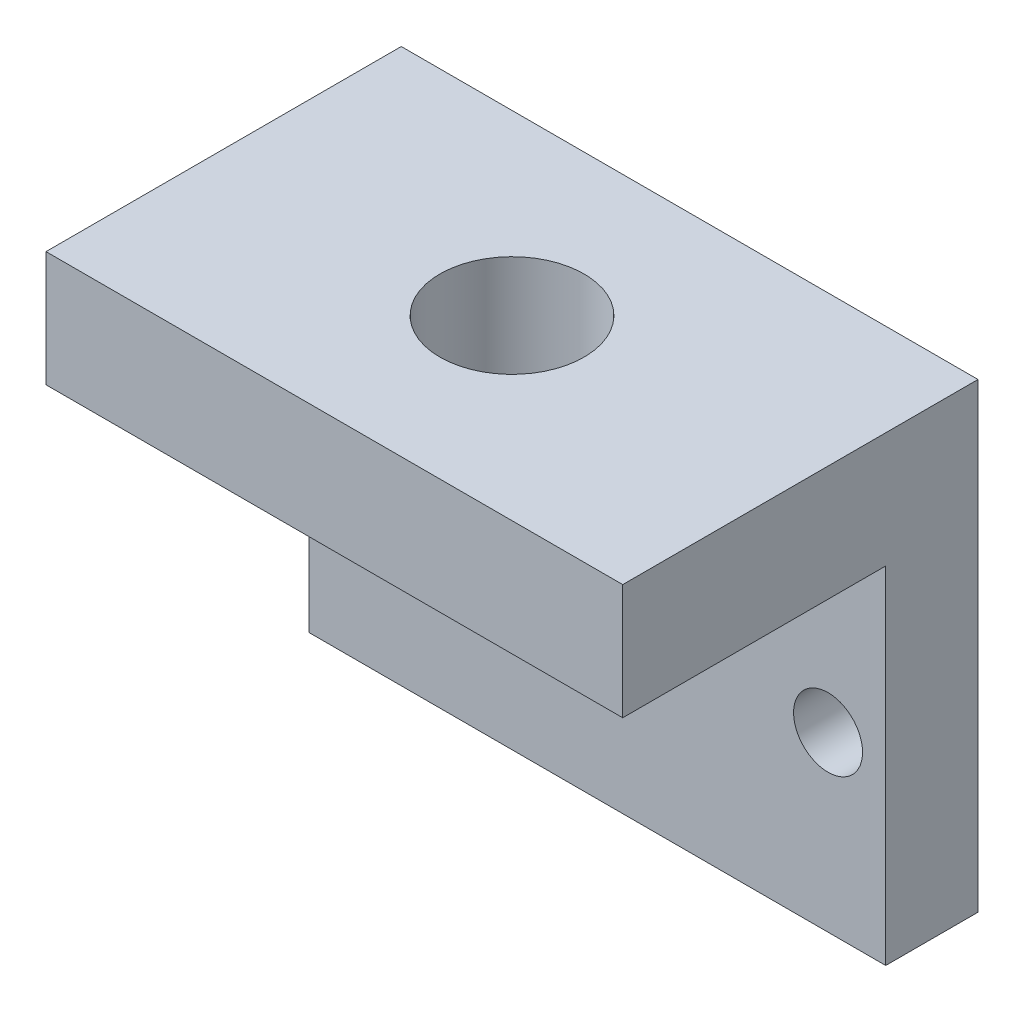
ISO-10303-21;
HEADER;
FILE_DESCRIPTION(('STEP AP214'),'2;1');
FILE_NAME('part.step','',(''),(''),'','','');
FILE_SCHEMA(('AUTOMOTIVE_DESIGN { 1 0 10303 214 1 1 1 1 }'));
ENDSEC;
DATA;
#1=APPLICATION_CONTEXT('core data for automotive mechanical design processes');
#2=APPLICATION_PROTOCOL_DEFINITION('international standard','automotive_design',2000,#1);
#3=PRODUCT_CONTEXT('',#1,'mechanical');
#4=PRODUCT('Part','Part','',(#3));
#5=PRODUCT_RELATED_PRODUCT_CATEGORY('part','',(#4));
#6=PRODUCT_DEFINITION_FORMATION('','',#4);
#7=PRODUCT_DEFINITION_CONTEXT('part definition',#1,'design');
#8=PRODUCT_DEFINITION('design','',#6,#7);
#9=PRODUCT_DEFINITION_SHAPE('','',#8);
#10=(LENGTH_UNIT() NAMED_UNIT(*) SI_UNIT(.MILLI.,.METRE.));
#11=(NAMED_UNIT(*) PLANE_ANGLE_UNIT() SI_UNIT($,.RADIAN.));
#12=(NAMED_UNIT(*) SI_UNIT($,.STERADIAN.) SOLID_ANGLE_UNIT());
#13=UNCERTAINTY_MEASURE_WITH_UNIT(LENGTH_MEASURE(1.E-05),#10,'distance_accuracy_value','');
#14=(GEOMETRIC_REPRESENTATION_CONTEXT(3) GLOBAL_UNCERTAINTY_ASSIGNED_CONTEXT((#13)) GLOBAL_UNIT_ASSIGNED_CONTEXT((#10,
#11,#12)) REPRESENTATION_CONTEXT('',''));
#15=CARTESIAN_POINT('',(0.,0.,0.));
#16=DIRECTION('',(0.,0.,1.));
#17=DIRECTION('',(1.,0.,0.));
#18=AXIS2_PLACEMENT_3D('',#15,#16,#17);
#19=CARTESIAN_POINT('',(-15.875,6.35,9.779));
#20=DIRECTION('',(0.,1.,0.));
#21=DIRECTION('',(0.,0.,1.));
#22=AXIS2_PLACEMENT_3D('',#19,#20,#21);
#23=PLANE('',#22);
#24=DIRECTION('',(0.,0.,1.));
#25=VECTOR('',#24,1.);
#26=CARTESIAN_POINT('',(-15.875,6.35,-9.779));
#27=LINE('',#26,#25);
#28=CARTESIAN_POINT('',(-15.875,6.35,-9.779));
#29=VERTEX_POINT('',#28);
#30=CARTESIAN_POINT('',(-15.875,6.35,9.779));
#31=VERTEX_POINT('',#30);
#32=EDGE_CURVE('E105',#29,#31,#27,.T.);
#33=ORIENTED_EDGE('',*,*,#32,.T.);
#34=DIRECTION('',(1.,0.,0.));
#35=VECTOR('',#34,1.);
#36=CARTESIAN_POINT('',(-15.875,6.35,9.779));
#37=LINE('',#36,#35);
#38=CARTESIAN_POINT('',(15.875,6.35,9.779));
#39=VERTEX_POINT('',#38);
#40=EDGE_CURVE('E102',#31,#39,#37,.T.);
#41=ORIENTED_EDGE('',*,*,#40,.T.);
#42=DIRECTION('',(0.,0.,-1.));
#43=VECTOR('',#42,1.);
#44=CARTESIAN_POINT('',(15.875,6.35,-9.779));
#45=LINE('',#44,#43);
#46=CARTESIAN_POINT('',(15.875,6.35,-9.779));
#47=VERTEX_POINT('',#46);
#48=EDGE_CURVE('E104',#39,#47,#45,.T.);
#49=ORIENTED_EDGE('',*,*,#48,.T.);
#50=DIRECTION('',(-1.,0.,0.));
#51=VECTOR('',#50,1.);
#52=CARTESIAN_POINT('',(-15.875,6.35,-9.779));
#53=LINE('',#52,#51);
#54=EDGE_CURVE('E53',#47,#29,#53,.T.);
#55=ORIENTED_EDGE('',*,*,#54,.T.);
#56=EDGE_LOOP('',(#33,#41,#49,#55));
#57=FACE_BOUND('',#56,.T.);
#58=CARTESIAN_POINT('',(0.,6.35,0.));
#59=DIRECTION('',(0.,1.,0.));
#60=DIRECTION('',(0.,0.,1.));
#61=AXIS2_PLACEMENT_3D('',#58,#59,#60);
#62=CIRCLE('',#61,3.96875);
#63=CARTESIAN_POINT('',(0.,6.35,3.96875));
#64=VERTEX_POINT('',#63);
#65=EDGE_CURVE('E109',#64,#64,#62,.T.);
#66=ORIENTED_EDGE('',*,*,#65,.F.);
#67=EDGE_LOOP('',(#66));
#68=FACE_BOUND('',#67,.T.);
#69=ADVANCED_FACE('F29',(#57,#68),#23,.T.);
#70=CARTESIAN_POINT('',(-15.875,6.35,-9.779));
#71=DIRECTION('',(1.,0.,0.));
#72=DIRECTION('',(0.,0.,-1.));
#73=AXIS2_PLACEMENT_3D('',#70,#71,#72);
#74=PLANE('',#73);
#75=DIRECTION('',(0.,0.,-1.));
#76=VECTOR('',#75,1.);
#77=CARTESIAN_POINT('',(-15.875,-19.05,9.779));
#78=LINE('',#77,#76);
#79=CARTESIAN_POINT('',(-15.875,-19.05,-4.69899999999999));
#80=VERTEX_POINT('',#79);
#81=CARTESIAN_POINT('',(-15.875,-19.05,-9.779));
#82=VERTEX_POINT('',#81);
#83=EDGE_CURVE('E133',#80,#82,#78,.T.);
#84=ORIENTED_EDGE('',*,*,#83,.F.);
#85=DIRECTION('',(0.,-1.,0.));
#86=VECTOR('',#85,1.);
#87=CARTESIAN_POINT('',(-15.875,0.,-4.69899999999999));
#88=LINE('',#87,#86);
#89=CARTESIAN_POINT('',(-15.875,0.,-4.69899999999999));
#90=VERTEX_POINT('',#89);
#91=EDGE_CURVE('E45',#90,#80,#88,.T.);
#92=ORIENTED_EDGE('',*,*,#91,.F.);
#93=DIRECTION('',(0.,0.,-1.));
#94=VECTOR('',#93,1.);
#95=CARTESIAN_POINT('',(-15.875,0.,9.77900000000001));
#96=LINE('',#95,#94);
#97=CARTESIAN_POINT('',(-15.875,0.,9.77900000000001));
#98=VERTEX_POINT('',#97);
#99=EDGE_CURVE('E87',#98,#90,#96,.T.);
#100=ORIENTED_EDGE('',*,*,#99,.F.);
#101=DIRECTION('',(0.,-1.,0.));
#102=VECTOR('',#101,1.);
#103=CARTESIAN_POINT('',(-15.875,6.35,9.779));
#104=LINE('',#103,#102);
#105=EDGE_CURVE('E11',#31,#98,#104,.T.);
#106=ORIENTED_EDGE('',*,*,#105,.F.);
#107=ORIENTED_EDGE('',*,*,#32,.F.);
#108=DIRECTION('',(0.,-1.,0.));
#109=VECTOR('',#108,1.);
#110=CARTESIAN_POINT('',(-15.875,6.35,-9.779));
#111=LINE('',#110,#109);
#112=EDGE_CURVE('E118',#29,#82,#111,.T.);
#113=ORIENTED_EDGE('',*,*,#112,.T.);
#114=EDGE_LOOP('',(#84,#92,#100,#106,#107,#113));
#115=FACE_BOUND('',#114,.T.);
#116=ADVANCED_FACE('F31',(#115),#74,.F.);
#117=CARTESIAN_POINT('',(-15.875,6.35,9.779));
#118=DIRECTION('',(0.,0.,-1.));
#119=DIRECTION('',(-1.,0.,0.));
#120=AXIS2_PLACEMENT_3D('',#117,#118,#119);
#121=PLANE('',#120);
#122=ORIENTED_EDGE('',*,*,#105,.T.);
#123=DIRECTION('',(-1.,0.,0.));
#124=VECTOR('',#123,1.);
#125=CARTESIAN_POINT('',(15.875,0.,9.779));
#126=LINE('',#125,#124);
#127=CARTESIAN_POINT('',(15.875,0.,9.779));
#128=VERTEX_POINT('',#127);
#129=EDGE_CURVE('E84',#128,#98,#126,.T.);
#130=ORIENTED_EDGE('',*,*,#129,.F.);
#131=DIRECTION('',(0.,-1.,0.));
#132=VECTOR('',#131,1.);
#133=CARTESIAN_POINT('',(15.875,6.35,9.779));
#134=LINE('',#133,#132);
#135=EDGE_CURVE('E38',#39,#128,#134,.T.);
#136=ORIENTED_EDGE('',*,*,#135,.F.);
#137=ORIENTED_EDGE('',*,*,#40,.F.);
#138=EDGE_LOOP('',(#122,#130,#136,#137));
#139=FACE_BOUND('',#138,.T.);
#140=ADVANCED_FACE('F101',(#139),#121,.F.);
#141=CARTESIAN_POINT('',(15.875,6.35,-9.779));
#142=DIRECTION('',(-1.,0.,0.));
#143=DIRECTION('',(0.,0.,1.));
#144=AXIS2_PLACEMENT_3D('',#141,#142,#143);
#145=PLANE('',#144);
#146=DIRECTION('',(0.,0.,-1.));
#147=VECTOR('',#146,1.);
#148=CARTESIAN_POINT('',(15.875,0.,9.779));
#149=LINE('',#148,#147);
#150=CARTESIAN_POINT('',(15.875,0.,-4.699));
#151=VERTEX_POINT('',#150);
#152=EDGE_CURVE('E89',#128,#151,#149,.T.);
#153=ORIENTED_EDGE('',*,*,#152,.T.);
#154=DIRECTION('',(0.,-1.,0.));
#155=VECTOR('',#154,1.);
#156=CARTESIAN_POINT('',(15.875,0.,-4.699));
#157=LINE('',#156,#155);
#158=CARTESIAN_POINT('',(15.875,-19.05,-4.69899999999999));
#159=VERTEX_POINT('',#158);
#160=EDGE_CURVE('E94',#151,#159,#157,.T.);
#161=ORIENTED_EDGE('',*,*,#160,.T.);
#162=DIRECTION('',(0.,0.,1.));
#163=VECTOR('',#162,1.);
#164=CARTESIAN_POINT('',(15.875,-19.05,-9.779));
#165=LINE('',#164,#163);
#166=CARTESIAN_POINT('',(15.875,-19.05,-9.779));
#167=VERTEX_POINT('',#166);
#168=EDGE_CURVE('E112',#167,#159,#165,.T.);
#169=ORIENTED_EDGE('',*,*,#168,.F.);
#170=DIRECTION('',(0.,-1.,0.));
#171=VECTOR('',#170,1.);
#172=CARTESIAN_POINT('',(15.875,6.35,-9.779));
#173=LINE('',#172,#171);
#174=EDGE_CURVE('E120',#47,#167,#173,.T.);
#175=ORIENTED_EDGE('',*,*,#174,.F.);
#176=ORIENTED_EDGE('',*,*,#48,.F.);
#177=ORIENTED_EDGE('',*,*,#135,.T.);
#178=EDGE_LOOP('',(#153,#161,#169,#175,#176,#177));
#179=FACE_BOUND('',#178,.T.);
#180=ADVANCED_FACE('F123',(#179),#145,.F.);
#181=CARTESIAN_POINT('',(-15.875,6.35,-9.779));
#182=DIRECTION('',(0.,0.,1.));
#183=DIRECTION('',(1.,0.,0.));
#184=AXIS2_PLACEMENT_3D('',#181,#182,#183);
#185=PLANE('',#184);
#186=CARTESIAN_POINT('',(12.7,-9.525,-9.779));
#187=DIRECTION('',(0.,0.,1.));
#188=DIRECTION('',(1.,0.,0.));
#189=AXIS2_PLACEMENT_3D('',#186,#187,#188);
#190=CIRCLE('',#189,1.89864999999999);
#191=CARTESIAN_POINT('',(14.59865,-9.525,-9.779));
#192=VERTEX_POINT('',#191);
#193=EDGE_CURVE('E139',#192,#192,#190,.T.);
#194=ORIENTED_EDGE('',*,*,#193,.T.);
#195=EDGE_LOOP('',(#194));
#196=FACE_BOUND('',#195,.T.);
#197=CARTESIAN_POINT('',(-12.7,-9.525,-9.779));
#198=DIRECTION('',(0.,0.,1.));
#199=DIRECTION('',(1.,0.,0.));
#200=AXIS2_PLACEMENT_3D('',#197,#198,#199);
#201=CIRCLE('',#200,1.89864999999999);
#202=CARTESIAN_POINT('',(-10.80135,-9.525,-9.779));
#203=VERTEX_POINT('',#202);
#204=EDGE_CURVE('E135',#203,#203,#201,.T.);
#205=ORIENTED_EDGE('',*,*,#204,.T.);
#206=EDGE_LOOP('',(#205));
#207=FACE_BOUND('',#206,.T.);
#208=ORIENTED_EDGE('',*,*,#174,.T.);
#209=DIRECTION('',(1.,0.,0.));
#210=VECTOR('',#209,1.);
#211=CARTESIAN_POINT('',(-15.875,-19.05,-9.779));
#212=LINE('',#211,#210);
#213=EDGE_CURVE('E132',#82,#167,#212,.T.);
#214=ORIENTED_EDGE('',*,*,#213,.F.);
#215=ORIENTED_EDGE('',*,*,#112,.F.);
#216=ORIENTED_EDGE('',*,*,#54,.F.);
#217=EDGE_LOOP('',(#208,#214,#215,#216));
#218=FACE_BOUND('',#217,.T.);
#219=ADVANCED_FACE('F131',(#196,#207,#218),#185,.F.);
#220=CARTESIAN_POINT('',(0.,6.35,0.));
#221=DIRECTION('',(0.,-1.,0.));
#222=DIRECTION('',(0.,0.,-1.));
#223=AXIS2_PLACEMENT_3D('',#220,#221,#222);
#224=CYLINDRICAL_SURFACE('',#223,3.96875);
#225=ORIENTED_EDGE('',*,*,#65,.T.);
#226=EDGE_LOOP('',(#225));
#227=FACE_BOUND('',#226,.T.);
#228=CARTESIAN_POINT('',(0.,0.,0.));
#229=DIRECTION('',(0.,1.,0.));
#230=DIRECTION('',(0.,0.,1.));
#231=AXIS2_PLACEMENT_3D('',#228,#229,#230);
#232=CIRCLE('',#231,3.96875);
#233=CARTESIAN_POINT('',(0.,0.,3.96875));
#234=VERTEX_POINT('',#233);
#235=EDGE_CURVE('E154',#234,#234,#232,.T.);
#236=ORIENTED_EDGE('',*,*,#235,.F.);
#237=EDGE_LOOP('',(#236));
#238=FACE_BOUND('',#237,.T.);
#239=ADVANCED_FACE('F184',(#227,#238),#224,.F.);
#240=CARTESIAN_POINT('',(-15.875,-19.05,9.779));
#241=DIRECTION('',(0.,-1.,0.));
#242=DIRECTION('',(0.,0.,-1.));
#243=AXIS2_PLACEMENT_3D('',#240,#241,#242);
#244=PLANE('',#243);
#245=DIRECTION('',(-1.,0.,0.));
#246=VECTOR('',#245,1.);
#247=CARTESIAN_POINT('',(15.875,-19.05,-4.69899999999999));
#248=LINE('',#247,#246);
#249=EDGE_CURVE('E143',#159,#80,#248,.T.);
#250=ORIENTED_EDGE('',*,*,#249,.T.);
#251=ORIENTED_EDGE('',*,*,#83,.T.);
#252=ORIENTED_EDGE('',*,*,#213,.T.);
#253=ORIENTED_EDGE('',*,*,#168,.T.);
#254=EDGE_LOOP('',(#250,#251,#252,#253));
#255=FACE_BOUND('',#254,.T.);
#256=ADVANCED_FACE('F142',(#255),#244,.T.);
#257=CARTESIAN_POINT('',(-12.7,-9.525,9.779));
#258=DIRECTION('',(0.,0.,1.));
#259=DIRECTION('',(1.,0.,0.));
#260=AXIS2_PLACEMENT_3D('',#257,#258,#259);
#261=CYLINDRICAL_SURFACE('',#260,1.89865);
#262=CARTESIAN_POINT('',(-12.7,-9.525,-4.69899999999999));
#263=DIRECTION('',(0.,0.,-1.));
#264=DIRECTION('',(-1.,0.,0.));
#265=AXIS2_PLACEMENT_3D('',#262,#263,#264);
#266=CIRCLE('',#265,1.89865);
#267=CARTESIAN_POINT('',(-14.59865,-9.525,-4.69899999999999));
#268=VERTEX_POINT('',#267);
#269=EDGE_CURVE('E147',#268,#268,#266,.F.);
#270=ORIENTED_EDGE('',*,*,#269,.T.);
#271=EDGE_LOOP('',(#270));
#272=FACE_BOUND('',#271,.T.);
#273=ORIENTED_EDGE('',*,*,#204,.F.);
#274=EDGE_LOOP('',(#273));
#275=FACE_BOUND('',#274,.T.);
#276=ADVANCED_FACE('F164',(#272,#275),#261,.F.);
#277=CARTESIAN_POINT('',(12.7,-9.525,9.779));
#278=DIRECTION('',(0.,0.,1.));
#279=DIRECTION('',(1.,0.,0.));
#280=AXIS2_PLACEMENT_3D('',#277,#278,#279);
#281=CYLINDRICAL_SURFACE('',#280,1.89865);
#282=CARTESIAN_POINT('',(12.7,-9.525,-4.699));
#283=DIRECTION('',(0.,0.,-1.));
#284=DIRECTION('',(-1.,0.,0.));
#285=AXIS2_PLACEMENT_3D('',#282,#283,#284);
#286=CIRCLE('',#285,1.89865);
#287=CARTESIAN_POINT('',(10.80135,-9.525,-4.699));
#288=VERTEX_POINT('',#287);
#289=EDGE_CURVE('E33',#288,#288,#286,.F.);
#290=ORIENTED_EDGE('',*,*,#289,.T.);
#291=EDGE_LOOP('',(#290));
#292=FACE_BOUND('',#291,.T.);
#293=ORIENTED_EDGE('',*,*,#193,.F.);
#294=EDGE_LOOP('',(#293));
#295=FACE_BOUND('',#294,.T.);
#296=ADVANCED_FACE('F161',(#292,#295),#281,.F.);
#297=CARTESIAN_POINT('',(15.875,0.,-4.699));
#298=DIRECTION('',(0.,0.,-1.));
#299=DIRECTION('',(-1.,0.,0.));
#300=AXIS2_PLACEMENT_3D('',#297,#298,#299);
#301=PLANE('',#300);
#302=ORIENTED_EDGE('',*,*,#289,.F.);
#303=EDGE_LOOP('',(#302));
#304=FACE_BOUND('',#303,.T.);
#305=ORIENTED_EDGE('',*,*,#91,.T.);
#306=ORIENTED_EDGE('',*,*,#249,.F.);
#307=ORIENTED_EDGE('',*,*,#160,.F.);
#308=DIRECTION('',(-1.,0.,0.));
#309=VECTOR('',#308,1.);
#310=CARTESIAN_POINT('',(15.875,0.,-4.699));
#311=LINE('',#310,#309);
#312=EDGE_CURVE('E93',#151,#90,#311,.T.);
#313=ORIENTED_EDGE('',*,*,#312,.T.);
#314=EDGE_LOOP('',(#305,#306,#307,#313));
#315=FACE_BOUND('',#314,.T.);
#316=ORIENTED_EDGE('',*,*,#269,.F.);
#317=EDGE_LOOP('',(#316));
#318=FACE_BOUND('',#317,.T.);
#319=ADVANCED_FACE('F163',(#304,#315,#318),#301,.F.);
#320=CARTESIAN_POINT('',(15.875,0.,9.779));
#321=DIRECTION('',(0.,1.,0.));
#322=DIRECTION('',(0.,0.,1.));
#323=AXIS2_PLACEMENT_3D('',#320,#321,#322);
#324=PLANE('',#323);
#325=ORIENTED_EDGE('',*,*,#235,.T.);
#326=EDGE_LOOP('',(#325));
#327=FACE_BOUND('',#326,.T.);
#328=ORIENTED_EDGE('',*,*,#99,.T.);
#329=ORIENTED_EDGE('',*,*,#312,.F.);
#330=ORIENTED_EDGE('',*,*,#152,.F.);
#331=ORIENTED_EDGE('',*,*,#129,.T.);
#332=EDGE_LOOP('',(#328,#329,#330,#331));
#333=FACE_BOUND('',#332,.T.);
#334=ADVANCED_FACE('F86',(#327,#333),#324,.F.);
#335=CLOSED_SHELL('',(#69,#116,#140,#180,#219,#239,#256,#276,#296,#319,#334));
#336=MANIFOLD_SOLID_BREP('B2',#335);
#337=ADVANCED_BREP_SHAPE_REPRESENTATION('',(#18,#336),#14);
#338=SHAPE_DEFINITION_REPRESENTATION(#9,#337);
ENDSEC;
END-ISO-10303-21;
